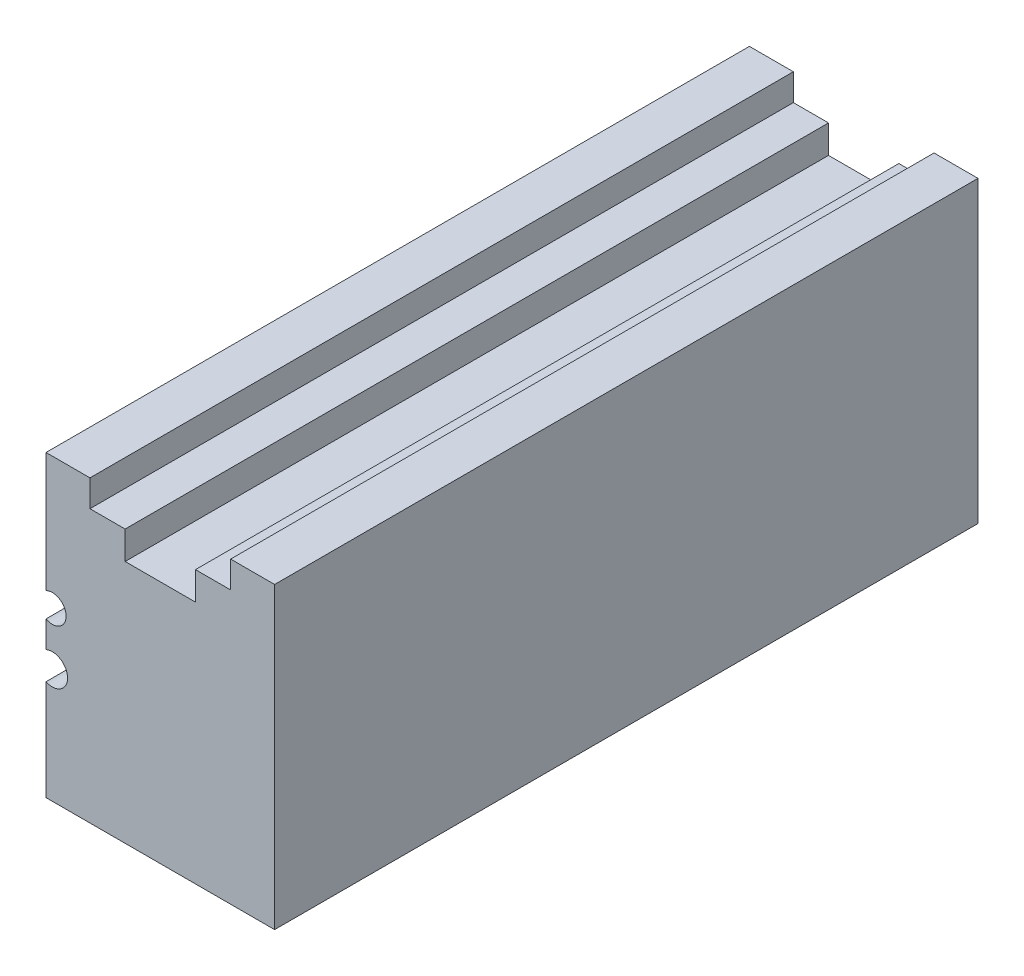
from build123d import *

# Parameters (mm, degrees)
SKETCH1_W                         = 41.275
SKETCH1_H                         = 53.975
BOSS_EXTRUDE1_DEPTH               = 127
CUT_EXTRUDE1_DEPTH                = 127
SKETCH3_R                         = 2.413
CUT_EXTRUDE2_DEPTH                = 6.35
F_1_4_20_TAPPED_HOLE1_D           = 5.1054
F_1_4_20_TAPPED_HOLE1_DEPTH       = 11.43
F_1_4_20_TAPPED_HOLE1_CSINK_D     = 7.62
F_1_4_20_TAPPED_HOLE1_CSINK_ANGLE = 90
F_1_4_20_TAPPED_HOLE1_TIP         = 1.533816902
SKETCH6_R                         = 2.48952844
SKETCH6_R_2                       = 2.755403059
CUT_EXTRUDE3_DEPTH                = 50.8
F_10_32_TAPPED_HOLE1_D            = 4.0386
F_10_32_TAPPED_HOLE1_DEPTH        = 11.938
F_10_32_TAPPED_HOLE1_CSINK_D      = 6.096
F_10_32_TAPPED_HOLE1_CSINK_ANGLE  = 90
F_10_32_TAPPED_HOLE1_TIP          = 1.213317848


with BuildPart() as part:
    # Sketch1 → Boss-Extrude1 (new body)
    with BuildSketch(Plane.XY):
        with Locations((20.6375, 26.9875)):
            Rectangle(SKETCH1_W, SKETCH1_H)
    extrude(amount=-BOSS_EXTRUDE1_DEPTH)

    # Sketch2 → Cut-Extrude1 (cut)
    with BuildSketch(Plane.XY):
        Polygon((7.9375, 53.975), (33.3375, 53.975), (33.3375, 49.149), (26.9875, 49.149), (26.9875, 44.069), (14.2875, 44.069), (14.2875, 49.149), (7.9375, 49.149), align=None)
    extrude(amount=-CUT_EXTRUDE1_DEPTH, mode=Mode.SUBTRACT)

    # Sketch3 → Cut-Extrude2 (cut)
    with BuildSketch(Plane.XZ):
        with Locations(Location((20.6375, -25.4, 0), (0, 0, 270))):
            Circle(SKETCH3_R)
        with Locations(Location((4.7625, -63.5, 0), (0, 0, 270))):
            Circle(SKETCH3_R)
        with Locations(Location((36.5125, -63.5, 0), (0, 0, 270))):
            Circle(SKETCH3_R)
        with Locations(Location((20.6375, -101.6, 0), (0, 0, 270))):
            Circle(SKETCH3_R)
    extrude(amount=-CUT_EXTRUDE2_DEPTH, mode=Mode.SUBTRACT)

    # 1_4-20 Tapped Hole1
    with Locations(Plane(origin=(0, 0, 0), x_dir=(-1, 0, 0), z_dir=(0, -1, 0))):
        with Locations((-4.7625, 38.1), (-36.5125, 38.1), (-36.5125, 88.9), (-4.7625, 88.9)):
            CounterSinkHole(F_1_4_20_TAPPED_HOLE1_D / 2, F_1_4_20_TAPPED_HOLE1_CSINK_D / 2, depth=F_1_4_20_TAPPED_HOLE1_DEPTH, counter_sink_angle=F_1_4_20_TAPPED_HOLE1_CSINK_ANGLE)
            with Locations((0, 0, -(F_1_4_20_TAPPED_HOLE1_DEPTH + F_1_4_20_TAPPED_HOLE1_TIP / 2))):  # 118° drill point
                Cone(0, F_1_4_20_TAPPED_HOLE1_D / 2, F_1_4_20_TAPPED_HOLE1_TIP, mode=Mode.SUBTRACT)

    # Sketch6 → Cut-Extrude3 (cut)
    with BuildSketch(Plane.XY):
        with Locations((1.143, 30.1625)):
            Circle(SKETCH6_R)
        with Locations((1.143, 20.6375)):
            Circle(SKETCH6_R_2)
    extrude(amount=-CUT_EXTRUDE3_DEPTH, mode=Mode.SUBTRACT)

    # 10-32 Tapped Hole1
    with Locations(Plane.ZY):
        with Locations((-120.015, 11.938), (-6.985, 11.938), (-63.5, 44.069)):
            CounterSinkHole(F_10_32_TAPPED_HOLE1_D / 2, F_10_32_TAPPED_HOLE1_CSINK_D / 2, depth=F_10_32_TAPPED_HOLE1_DEPTH, counter_sink_angle=F_10_32_TAPPED_HOLE1_CSINK_ANGLE)
            with Locations((0, 0, -(F_10_32_TAPPED_HOLE1_DEPTH + F_10_32_TAPPED_HOLE1_TIP / 2))):  # 118° drill point
                Cone(0, F_10_32_TAPPED_HOLE1_D / 2, F_10_32_TAPPED_HOLE1_TIP, mode=Mode.SUBTRACT)


solid = part.part
